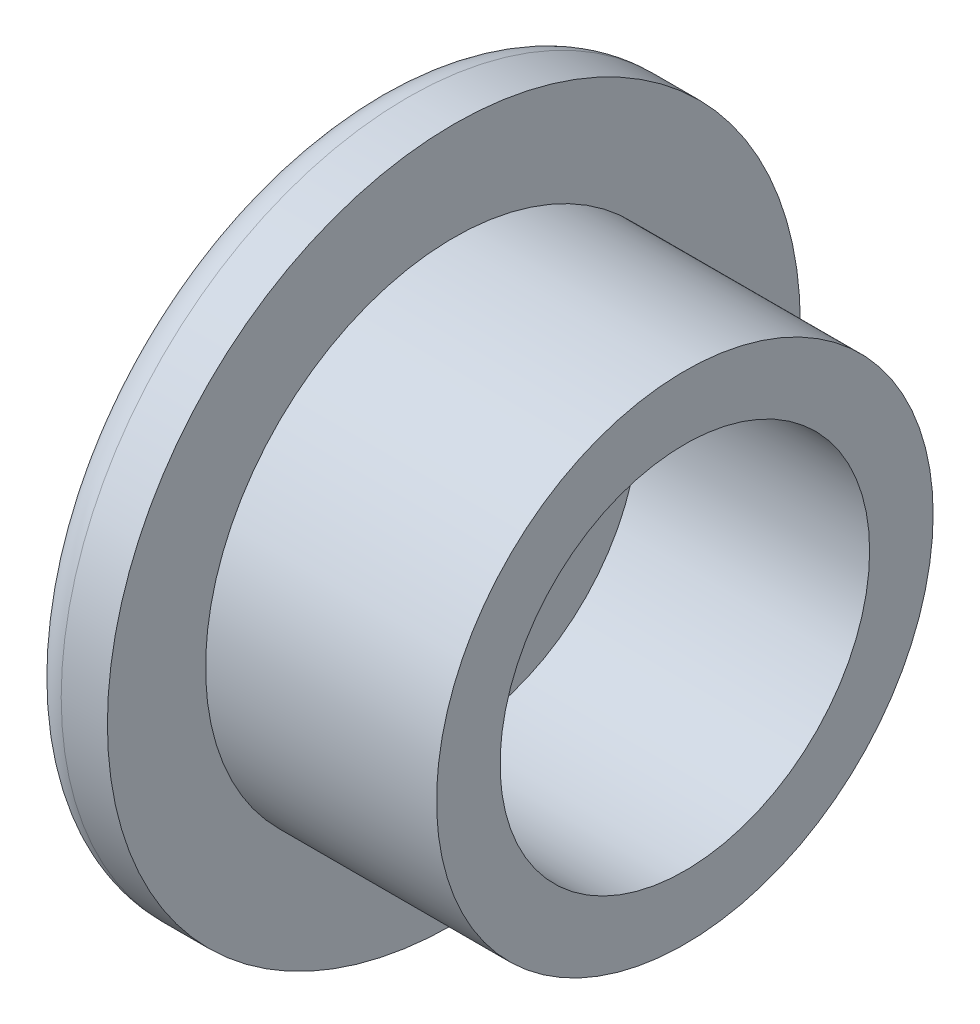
ISO-10303-21;
HEADER;
FILE_DESCRIPTION(('STEP AP214'),'2;1');
FILE_NAME('part.step','',(''),(''),'','','');
FILE_SCHEMA(('AUTOMOTIVE_DESIGN { 1 0 10303 214 1 1 1 1 }'));
ENDSEC;
DATA;
#1=APPLICATION_CONTEXT('core data for automotive mechanical design processes');
#2=APPLICATION_PROTOCOL_DEFINITION('international standard','automotive_design',2000,#1);
#3=PRODUCT_CONTEXT('',#1,'mechanical');
#4=PRODUCT('Part','Part','',(#3));
#5=PRODUCT_RELATED_PRODUCT_CATEGORY('part','',(#4));
#6=PRODUCT_DEFINITION_FORMATION('','',#4);
#7=PRODUCT_DEFINITION_CONTEXT('part definition',#1,'design');
#8=PRODUCT_DEFINITION('design','',#6,#7);
#9=PRODUCT_DEFINITION_SHAPE('','',#8);
#10=(LENGTH_UNIT() NAMED_UNIT(*) SI_UNIT(.MILLI.,.METRE.));
#11=(NAMED_UNIT(*) PLANE_ANGLE_UNIT() SI_UNIT($,.RADIAN.));
#12=(NAMED_UNIT(*) SI_UNIT($,.STERADIAN.) SOLID_ANGLE_UNIT());
#13=UNCERTAINTY_MEASURE_WITH_UNIT(LENGTH_MEASURE(1.E-05),#10,'distance_accuracy_value','');
#14=(GEOMETRIC_REPRESENTATION_CONTEXT(3) GLOBAL_UNCERTAINTY_ASSIGNED_CONTEXT((#13)) GLOBAL_UNIT_ASSIGNED_CONTEXT((#10,
#11,#12)) REPRESENTATION_CONTEXT('',''));
#15=CARTESIAN_POINT('',(0.,0.,0.));
#16=DIRECTION('',(0.,0.,1.));
#17=DIRECTION('',(1.,0.,0.));
#18=AXIS2_PLACEMENT_3D('',#15,#16,#17);
#19=CARTESIAN_POINT('',(10.,0.,0.));
#20=DIRECTION('',(1.,0.,0.));
#21=DIRECTION('',(0.,0.,-1.));
#22=AXIS2_PLACEMENT_3D('',#19,#20,#21);
#23=PLANE('',#22);
#24=CARTESIAN_POINT('',(10.,0.,0.));
#25=DIRECTION('',(1.,0.,0.));
#26=DIRECTION('',(0.,0.,-1.));
#27=AXIS2_PLACEMENT_3D('',#24,#25,#26);
#28=CIRCLE('',#27,10.75);
#29=CARTESIAN_POINT('',(10.,0.,-10.75));
#30=VERTEX_POINT('',#29);
#31=EDGE_CURVE('E46',#30,#30,#28,.T.);
#32=ORIENTED_EDGE('',*,*,#31,.T.);
#33=EDGE_LOOP('',(#32));
#34=FACE_BOUND('',#33,.T.);
#35=CARTESIAN_POINT('',(10.,0.,0.));
#36=DIRECTION('',(1.,0.,0.));
#37=DIRECTION('',(0.,0.,-1.));
#38=AXIS2_PLACEMENT_3D('',#35,#36,#37);
#39=CIRCLE('',#38,8.);
#40=CARTESIAN_POINT('',(10.,0.,-8.));
#41=VERTEX_POINT('',#40);
#42=EDGE_CURVE('E50',#41,#41,#39,.T.);
#43=ORIENTED_EDGE('',*,*,#42,.F.);
#44=EDGE_LOOP('',(#43));
#45=FACE_BOUND('',#44,.T.);
#46=ADVANCED_FACE('F35',(#34,#45),#23,.T.);
#47=CARTESIAN_POINT('',(10.,0.,0.));
#48=DIRECTION('',(-1.,0.,0.));
#49=DIRECTION('',(0.,0.,1.));
#50=AXIS2_PLACEMENT_3D('',#47,#48,#49);
#51=CYLINDRICAL_SURFACE('',#50,10.75);
#52=ORIENTED_EDGE('',*,*,#31,.F.);
#53=EDGE_LOOP('',(#52));
#54=FACE_BOUND('',#53,.T.);
#55=CARTESIAN_POINT('',(0.,0.,0.));
#56=DIRECTION('',(1.,0.,0.));
#57=DIRECTION('',(0.,0.,-1.));
#58=AXIS2_PLACEMENT_3D('',#55,#56,#57);
#59=CIRCLE('',#58,10.75);
#60=CARTESIAN_POINT('',(0.,0.,-10.75));
#61=VERTEX_POINT('',#60);
#62=EDGE_CURVE('E53',#61,#61,#59,.T.);
#63=ORIENTED_EDGE('',*,*,#62,.T.);
#64=EDGE_LOOP('',(#63));
#65=FACE_BOUND('',#64,.T.);
#66=ADVANCED_FACE('F85',(#54,#65),#51,.T.);
#67=CARTESIAN_POINT('',(10.,0.,0.));
#68=DIRECTION('',(-1.,0.,0.));
#69=DIRECTION('',(0.,0.,1.));
#70=AXIS2_PLACEMENT_3D('',#67,#68,#69);
#71=CYLINDRICAL_SURFACE('',#70,8.);
#72=ORIENTED_EDGE('',*,*,#42,.T.);
#73=EDGE_LOOP('',(#72));
#74=FACE_BOUND('',#73,.T.);
#75=CARTESIAN_POINT('',(0.,0.,0.));
#76=DIRECTION('',(1.,0.,0.));
#77=DIRECTION('',(0.,0.,-1.));
#78=AXIS2_PLACEMENT_3D('',#75,#76,#77);
#79=CIRCLE('',#78,8.);
#80=CARTESIAN_POINT('',(0.,0.,-8.));
#81=VERTEX_POINT('',#80);
#82=EDGE_CURVE('E55',#81,#81,#79,.T.);
#83=ORIENTED_EDGE('',*,*,#82,.F.);
#84=EDGE_LOOP('',(#83));
#85=FACE_BOUND('',#84,.T.);
#86=ADVANCED_FACE('F82',(#74,#85),#71,.F.);
#87=CARTESIAN_POINT('',(0.,0.,0.));
#88=DIRECTION('',(-1.,0.,0.));
#89=DIRECTION('',(0.,0.,1.));
#90=AXIS2_PLACEMENT_3D('',#87,#88,#89);
#91=PLANE('',#90);
#92=ORIENTED_EDGE('',*,*,#82,.T.);
#93=EDGE_LOOP('',(#92));
#94=FACE_BOUND('',#93,.T.);
#95=ADVANCED_FACE('F72',(#94),#91,.F.);
#96=CARTESIAN_POINT('',(-3.5,0.,0.));
#97=DIRECTION('',(1.,0.,0.));
#98=DIRECTION('',(0.,0.,-1.));
#99=AXIS2_PLACEMENT_3D('',#96,#97,#98);
#100=CYLINDRICAL_SURFACE('',#99,15.);
#101=CARTESIAN_POINT('',(-2.,0.,0.));
#102=DIRECTION('',(-1.,0.,0.));
#103=DIRECTION('',(0.,0.,1.));
#104=AXIS2_PLACEMENT_3D('',#101,#102,#103);
#105=CIRCLE('',#104,15.);
#106=CARTESIAN_POINT('',(-2.,0.,15.));
#107=VERTEX_POINT('',#106);
#108=EDGE_CURVE('E10',#107,#107,#105,.F.);
#109=ORIENTED_EDGE('',*,*,#108,.T.);
#110=EDGE_LOOP('',(#109));
#111=FACE_BOUND('',#110,.T.);
#112=CARTESIAN_POINT('',(0.,0.,0.));
#113=DIRECTION('',(-1.,0.,0.));
#114=DIRECTION('',(0.,0.,1.));
#115=AXIS2_PLACEMENT_3D('',#112,#113,#114);
#116=CIRCLE('',#115,15.);
#117=CARTESIAN_POINT('',(0.,0.,15.));
#118=VERTEX_POINT('',#117);
#119=EDGE_CURVE('E56',#118,#118,#116,.T.);
#120=ORIENTED_EDGE('',*,*,#119,.T.);
#121=EDGE_LOOP('',(#120));
#122=FACE_BOUND('',#121,.T.);
#123=ADVANCED_FACE('F65',(#111,#122),#100,.T.);
#124=CARTESIAN_POINT('',(-3.5,0.,0.));
#125=DIRECTION('',(-1.,0.,0.));
#126=DIRECTION('',(0.,0.,1.));
#127=AXIS2_PLACEMENT_3D('',#124,#125,#126);
#128=PLANE('',#127);
#129=CARTESIAN_POINT('',(-3.5,0.,0.));
#130=DIRECTION('',(-1.,0.,0.));
#131=DIRECTION('',(0.,0.,1.));
#132=AXIS2_PLACEMENT_3D('',#129,#130,#131);
#133=CIRCLE('',#132,13.5);
#134=CARTESIAN_POINT('',(-3.5,0.,13.5));
#135=VERTEX_POINT('',#134);
#136=EDGE_CURVE('E42',#135,#135,#133,.T.);
#137=ORIENTED_EDGE('',*,*,#136,.T.);
#138=EDGE_LOOP('',(#137));
#139=FACE_BOUND('',#138,.T.);
#140=ADVANCED_FACE('F69',(#139),#128,.T.);
#141=ORIENTED_EDGE('',*,*,#62,.F.);
#142=EDGE_LOOP('',(#141));
#143=FACE_BOUND('',#142,.T.);
#144=ORIENTED_EDGE('',*,*,#119,.F.);
#145=EDGE_LOOP('',(#144));
#146=FACE_BOUND('',#145,.T.);
#147=ADVANCED_FACE('F67',(#143,#146),#91,.F.);
#148=CARTESIAN_POINT('',(-2.,0.,0.));
#149=DIRECTION('',(-1.,0.,0.));
#150=DIRECTION('',(0.,0.,1.));
#151=AXIS2_PLACEMENT_3D('',#148,#149,#150);
#152=TOROIDAL_SURFACE('',#151,13.5,1.5);
#153=ORIENTED_EDGE('',*,*,#108,.F.);
#154=EDGE_LOOP('',(#153));
#155=FACE_BOUND('',#154,.T.);
#156=ORIENTED_EDGE('',*,*,#136,.F.);
#157=EDGE_LOOP('',(#156));
#158=FACE_BOUND('',#157,.T.);
#159=ADVANCED_FACE('F37',(#155,#158),#152,.T.);
#160=CLOSED_SHELL('',(#46,#66,#86,#95,#123,#140,#147,#159));
#161=MANIFOLD_SOLID_BREP('B2',#160);
#162=ADVANCED_BREP_SHAPE_REPRESENTATION('',(#18,#161),#14);
#163=SHAPE_DEFINITION_REPRESENTATION(#9,#162);
ENDSEC;
END-ISO-10303-21;
